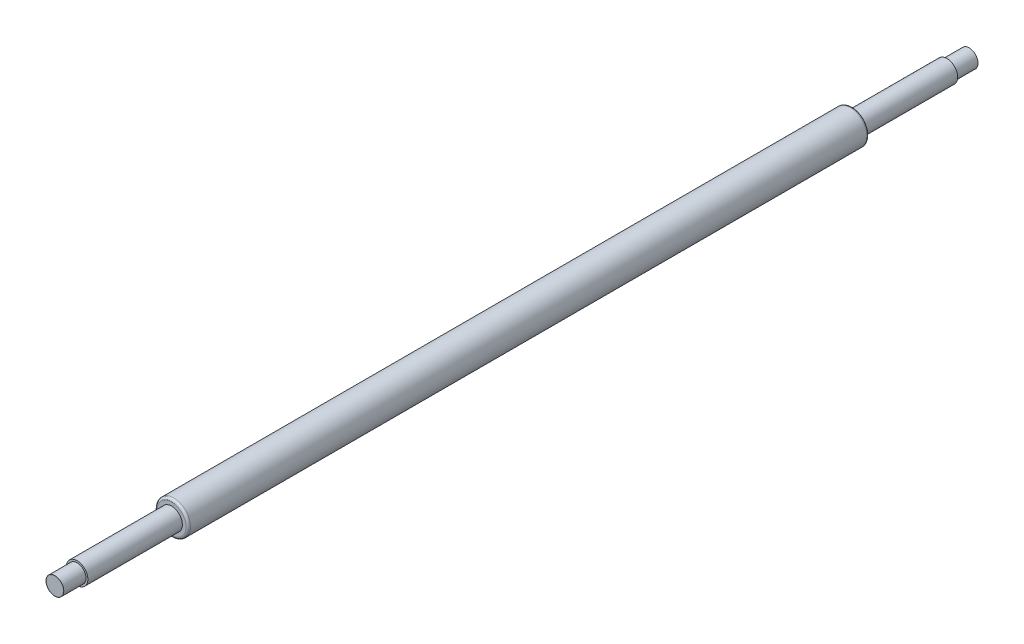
ISO-10303-21;
HEADER;
FILE_DESCRIPTION(('STEP AP214'),'2;1');
FILE_NAME('part.step','',(''),(''),'','','');
FILE_SCHEMA(('AUTOMOTIVE_DESIGN { 1 0 10303 214 1 1 1 1 }'));
ENDSEC;
DATA;
#1=APPLICATION_CONTEXT('core data for automotive mechanical design processes');
#2=APPLICATION_PROTOCOL_DEFINITION('international standard','automotive_design',2000,#1);
#3=PRODUCT_CONTEXT('',#1,'mechanical');
#4=PRODUCT('Part','Part','',(#3));
#5=PRODUCT_RELATED_PRODUCT_CATEGORY('part','',(#4));
#6=PRODUCT_DEFINITION_FORMATION('','',#4);
#7=PRODUCT_DEFINITION_CONTEXT('part definition',#1,'design');
#8=PRODUCT_DEFINITION('design','',#6,#7);
#9=PRODUCT_DEFINITION_SHAPE('','',#8);
#10=(LENGTH_UNIT() NAMED_UNIT(*) SI_UNIT(.MILLI.,.METRE.));
#11=(NAMED_UNIT(*) PLANE_ANGLE_UNIT() SI_UNIT($,.RADIAN.));
#12=(NAMED_UNIT(*) SI_UNIT($,.STERADIAN.) SOLID_ANGLE_UNIT());
#13=UNCERTAINTY_MEASURE_WITH_UNIT(LENGTH_MEASURE(1.E-05),#10,'distance_accuracy_value','');
#14=(GEOMETRIC_REPRESENTATION_CONTEXT(3) GLOBAL_UNCERTAINTY_ASSIGNED_CONTEXT((#13)) GLOBAL_UNIT_ASSIGNED_CONTEXT((#10,
#11,#12)) REPRESENTATION_CONTEXT('',''));
#15=CARTESIAN_POINT('',(0.,0.,0.));
#16=DIRECTION('',(0.,0.,1.));
#17=DIRECTION('',(1.,0.,0.));
#18=AXIS2_PLACEMENT_3D('',#15,#16,#17);
#19=CARTESIAN_POINT('',(0.,0.,455.549));
#20=DIRECTION('',(0.,0.,1.));
#21=DIRECTION('',(1.,0.,0.));
#22=AXIS2_PLACEMENT_3D('',#19,#20,#21);
#23=CYLINDRICAL_SURFACE('',#22,6.1595);
#24=CARTESIAN_POINT('',(0.,0.,455.549));
#25=DIRECTION('',(0.,0.,1.));
#26=DIRECTION('',(1.,0.,0.));
#27=AXIS2_PLACEMENT_3D('',#24,#25,#26);
#28=CIRCLE('',#27,6.1595);
#29=CARTESIAN_POINT('',(6.1595,0.,455.549));
#30=VERTEX_POINT('',#29);
#31=EDGE_CURVE('E57',#30,#30,#28,.T.);
#32=ORIENTED_EDGE('',*,*,#31,.T.);
#33=EDGE_LOOP('',(#32));
#34=FACE_BOUND('',#33,.T.);
#35=CARTESIAN_POINT('',(0.,0.,509.524));
#36=DIRECTION('',(0.,0.,1.));
#37=DIRECTION('',(1.,0.,0.));
#38=AXIS2_PLACEMENT_3D('',#35,#36,#37);
#39=CIRCLE('',#38,6.1595);
#40=CARTESIAN_POINT('',(6.1595,0.,509.524));
#41=VERTEX_POINT('',#40);
#42=EDGE_CURVE('E139',#41,#41,#39,.T.);
#43=ORIENTED_EDGE('',*,*,#42,.F.);
#44=EDGE_LOOP('',(#43));
#45=FACE_BOUND('',#44,.T.);
#46=ADVANCED_FACE('F34',(#34,#45),#23,.T.);
#47=CARTESIAN_POINT('',(0.,0.,66.675));
#48=DIRECTION('',(0.,0.,-1.));
#49=DIRECTION('',(-1.,0.,0.));
#50=AXIS2_PLACEMENT_3D('',#47,#48,#49);
#51=CYLINDRICAL_SURFACE('',#50,6.1595);
#52=CARTESIAN_POINT('',(0.,0.,66.675));
#53=DIRECTION('',(0.,0.,-1.));
#54=DIRECTION('',(-1.,0.,0.));
#55=AXIS2_PLACEMENT_3D('',#52,#53,#54);
#56=CIRCLE('',#55,6.1595);
#57=CARTESIAN_POINT('',(-6.1595,0.,66.675));
#58=VERTEX_POINT('',#57);
#59=EDGE_CURVE('E52',#58,#58,#56,.T.);
#60=ORIENTED_EDGE('',*,*,#59,.T.);
#61=EDGE_LOOP('',(#60));
#62=FACE_BOUND('',#61,.T.);
#63=CARTESIAN_POINT('',(0.,0.,12.7));
#64=DIRECTION('',(0.,0.,-1.));
#65=DIRECTION('',(-1.,0.,0.));
#66=AXIS2_PLACEMENT_3D('',#63,#64,#65);
#67=CIRCLE('',#66,6.1595);
#68=CARTESIAN_POINT('',(-6.1595,0.,12.7));
#69=VERTEX_POINT('',#68);
#70=EDGE_CURVE('E53',#69,#69,#67,.T.);
#71=ORIENTED_EDGE('',*,*,#70,.F.);
#72=EDGE_LOOP('',(#71));
#73=FACE_BOUND('',#72,.T.);
#74=ADVANCED_FACE('F97',(#62,#73),#51,.T.);
#75=CARTESIAN_POINT('',(0.,0.,522.224));
#76=DIRECTION('',(0.,0.,-1.));
#77=DIRECTION('',(-1.,0.,0.));
#78=AXIS2_PLACEMENT_3D('',#75,#76,#77);
#79=CYLINDRICAL_SURFACE('',#78,9.525);
#80=CARTESIAN_POINT('',(0.,0.,454.279));
#81=DIRECTION('',(0.,0.,1.));
#82=DIRECTION('',(1.,0.,0.));
#83=AXIS2_PLACEMENT_3D('',#80,#81,#82);
#84=CIRCLE('',#83,9.525);
#85=CARTESIAN_POINT('',(9.525,0.,454.279));
#86=VERTEX_POINT('',#85);
#87=EDGE_CURVE('E42',#86,#86,#84,.F.);
#88=ORIENTED_EDGE('',*,*,#87,.T.);
#89=EDGE_LOOP('',(#88));
#90=FACE_BOUND('',#89,.T.);
#91=CARTESIAN_POINT('',(0.,0.,67.945));
#92=DIRECTION('',(0.,0.,-1.));
#93=DIRECTION('',(-1.,0.,0.));
#94=AXIS2_PLACEMENT_3D('',#91,#92,#93);
#95=CIRCLE('',#94,9.525);
#96=CARTESIAN_POINT('',(-9.525,0.,67.945));
#97=VERTEX_POINT('',#96);
#98=EDGE_CURVE('E47',#97,#97,#95,.F.);
#99=ORIENTED_EDGE('',*,*,#98,.T.);
#100=EDGE_LOOP('',(#99));
#101=FACE_BOUND('',#100,.T.);
#102=ADVANCED_FACE('F81',(#90,#101),#79,.T.);
#103=CARTESIAN_POINT('',(0.,0.,455.549));
#104=DIRECTION('',(0.,0.,1.));
#105=DIRECTION('',(1.,0.,0.));
#106=AXIS2_PLACEMENT_3D('',#103,#104,#105);
#107=PLANE('',#106);
#108=CARTESIAN_POINT('',(0.,0.,455.549));
#109=DIRECTION('',(0.,0.,1.));
#110=DIRECTION('',(1.,0.,0.));
#111=AXIS2_PLACEMENT_3D('',#108,#109,#110);
#112=CIRCLE('',#111,8.255);
#113=CARTESIAN_POINT('',(8.255,0.,455.549));
#114=VERTEX_POINT('',#113);
#115=EDGE_CURVE('E76',#114,#114,#112,.T.);
#116=ORIENTED_EDGE('',*,*,#115,.T.);
#117=EDGE_LOOP('',(#116));
#118=FACE_BOUND('',#117,.T.);
#119=ORIENTED_EDGE('',*,*,#31,.F.);
#120=EDGE_LOOP('',(#119));
#121=FACE_BOUND('',#120,.T.);
#122=ADVANCED_FACE('F108',(#118,#121),#107,.T.);
#123=CARTESIAN_POINT('',(0.,0.,66.675));
#124=DIRECTION('',(0.,0.,-1.));
#125=DIRECTION('',(-1.,0.,0.));
#126=AXIS2_PLACEMENT_3D('',#123,#124,#125);
#127=PLANE('',#126);
#128=CARTESIAN_POINT('',(0.,0.,66.675));
#129=DIRECTION('',(0.,0.,-1.));
#130=DIRECTION('',(-1.,0.,0.));
#131=AXIS2_PLACEMENT_3D('',#128,#129,#130);
#132=CIRCLE('',#131,8.255);
#133=CARTESIAN_POINT('',(-8.255,0.,66.675));
#134=VERTEX_POINT('',#133);
#135=EDGE_CURVE('E10',#134,#134,#132,.T.);
#136=ORIENTED_EDGE('',*,*,#135,.T.);
#137=EDGE_LOOP('',(#136));
#138=FACE_BOUND('',#137,.T.);
#139=ORIENTED_EDGE('',*,*,#59,.F.);
#140=EDGE_LOOP('',(#139));
#141=FACE_BOUND('',#140,.T.);
#142=ADVANCED_FACE('F94',(#138,#141),#127,.T.);
#143=CARTESIAN_POINT('',(0.,0.,454.279));
#144=DIRECTION('',(0.,0.,1.));
#145=DIRECTION('',(1.,0.,0.));
#146=AXIS2_PLACEMENT_3D('',#143,#144,#145);
#147=TOROIDAL_SURFACE('',#146,8.255,1.27);
#148=ORIENTED_EDGE('',*,*,#87,.F.);
#149=EDGE_LOOP('',(#148));
#150=FACE_BOUND('',#149,.T.);
#151=ORIENTED_EDGE('',*,*,#115,.F.);
#152=EDGE_LOOP('',(#151));
#153=FACE_BOUND('',#152,.T.);
#154=ADVANCED_FACE('F86',(#150,#153),#147,.T.);
#155=CARTESIAN_POINT('',(0.,0.,67.945));
#156=DIRECTION('',(0.,0.,-1.));
#157=DIRECTION('',(-1.,0.,0.));
#158=AXIS2_PLACEMENT_3D('',#155,#156,#157);
#159=TOROIDAL_SURFACE('',#158,8.255,1.27);
#160=ORIENTED_EDGE('',*,*,#98,.F.);
#161=EDGE_LOOP('',(#160));
#162=FACE_BOUND('',#161,.T.);
#163=ORIENTED_EDGE('',*,*,#135,.F.);
#164=EDGE_LOOP('',(#163));
#165=FACE_BOUND('',#164,.T.);
#166=ADVANCED_FACE('F36',(#162,#165),#159,.T.);
#167=CARTESIAN_POINT('',(0.,0.,12.7));
#168=DIRECTION('',(0.,0.,-1.));
#169=DIRECTION('',(-1.,0.,0.));
#170=AXIS2_PLACEMENT_3D('',#167,#168,#169);
#171=PLANE('',#170);
#172=CARTESIAN_POINT('',(0.,0.,12.7));
#173=DIRECTION('',(0.,0.,-1.));
#174=DIRECTION('',(-1.,0.,0.));
#175=AXIS2_PLACEMENT_3D('',#172,#173,#174);
#176=CIRCLE('',#175,5.08);
#177=CARTESIAN_POINT('',(-5.08,0.,12.7));
#178=VERTEX_POINT('',#177);
#179=EDGE_CURVE('E60',#178,#178,#176,.T.);
#180=ORIENTED_EDGE('',*,*,#179,.F.);
#181=EDGE_LOOP('',(#180));
#182=FACE_BOUND('',#181,.T.);
#183=ORIENTED_EDGE('',*,*,#70,.T.);
#184=EDGE_LOOP('',(#183));
#185=FACE_BOUND('',#184,.T.);
#186=ADVANCED_FACE('F85',(#182,#185),#171,.T.);
#187=CARTESIAN_POINT('',(0.,0.,12.7));
#188=DIRECTION('',(0.,0.,-1.));
#189=DIRECTION('',(-1.,0.,0.));
#190=AXIS2_PLACEMENT_3D('',#187,#188,#189);
#191=CYLINDRICAL_SURFACE('',#190,5.08);
#192=CARTESIAN_POINT('',(0.,0.,0.0143687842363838));
#193=DIRECTION('',(0.,0.,1.));
#194=DIRECTION('',(1.,0.,0.));
#195=AXIS2_PLACEMENT_3D('',#192,#193,#194);
#196=CIRCLE('',#195,5.08);
#197=CARTESIAN_POINT('',(5.08,0.,0.0143687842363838));
#198=VERTEX_POINT('',#197);
#199=EDGE_CURVE('E50',#198,#198,#196,.F.);
#200=ORIENTED_EDGE('',*,*,#199,.F.);
#201=EDGE_LOOP('',(#200));
#202=FACE_BOUND('',#201,.T.);
#203=ORIENTED_EDGE('',*,*,#179,.T.);
#204=EDGE_LOOP('',(#203));
#205=FACE_BOUND('',#204,.T.);
#206=ADVANCED_FACE('F91',(#202,#205),#191,.T.);
#207=CARTESIAN_POINT('',(0.,0.,0.));
#208=DIRECTION('',(0.,0.,1.));
#209=DIRECTION('',(1.,0.,0.));
#210=AXIS2_PLACEMENT_3D('',#207,#208,#209);
#211=PLANE('',#210);
#212=CARTESIAN_POINT('',(0.,0.,0.));
#213=DIRECTION('',(0.,0.,1.));
#214=DIRECTION('',(1.,0.,0.));
#215=AXIS2_PLACEMENT_3D('',#212,#213,#214);
#216=CIRCLE('',#215,4.8895);
#217=CARTESIAN_POINT('',(4.8895,0.,0.));
#218=VERTEX_POINT('',#217);
#219=EDGE_CURVE('E70',#218,#218,#216,.F.);
#220=ORIENTED_EDGE('',*,*,#219,.T.);
#221=EDGE_LOOP('',(#220));
#222=FACE_BOUND('',#221,.T.);
#223=ADVANCED_FACE('F118',(#222),#211,.F.);
#224=CARTESIAN_POINT('',(0.,0.,1.26999999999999));
#225=DIRECTION('',(0.,0.,1.));
#226=DIRECTION('',(1.,0.,0.));
#227=AXIS2_PLACEMENT_3D('',#224,#225,#226);
#228=TOROIDAL_SURFACE('',#227,4.8895,1.27);
#229=ORIENTED_EDGE('',*,*,#219,.F.);
#230=EDGE_LOOP('',(#229));
#231=FACE_BOUND('',#230,.T.);
#232=ORIENTED_EDGE('',*,*,#199,.T.);
#233=EDGE_LOOP('',(#232));
#234=FACE_BOUND('',#233,.T.);
#235=ADVANCED_FACE('F121',(#231,#234),#228,.T.);
#236=CARTESIAN_POINT('',(0.,0.,509.524));
#237=DIRECTION('',(0.,0.,1.));
#238=DIRECTION('',(1.,0.,0.));
#239=AXIS2_PLACEMENT_3D('',#236,#237,#238);
#240=PLANE('',#239);
#241=CARTESIAN_POINT('',(0.,0.,509.524));
#242=DIRECTION('',(0.,0.,1.));
#243=DIRECTION('',(1.,0.,0.));
#244=AXIS2_PLACEMENT_3D('',#241,#242,#243);
#245=CIRCLE('',#244,5.08);
#246=CARTESIAN_POINT('',(5.08,0.,509.524));
#247=VERTEX_POINT('',#246);
#248=EDGE_CURVE('E141',#247,#247,#245,.T.);
#249=ORIENTED_EDGE('',*,*,#248,.F.);
#250=EDGE_LOOP('',(#249));
#251=FACE_BOUND('',#250,.T.);
#252=ORIENTED_EDGE('',*,*,#42,.T.);
#253=EDGE_LOOP('',(#252));
#254=FACE_BOUND('',#253,.T.);
#255=ADVANCED_FACE('F128',(#251,#254),#240,.T.);
#256=CARTESIAN_POINT('',(0.,0.,509.524));
#257=DIRECTION('',(0.,0.,1.));
#258=DIRECTION('',(1.,0.,0.));
#259=AXIS2_PLACEMENT_3D('',#256,#257,#258);
#260=CYLINDRICAL_SURFACE('',#259,5.08);
#261=CARTESIAN_POINT('',(0.,0.,522.209631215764));
#262=DIRECTION('',(0.,0.,-1.));
#263=DIRECTION('',(-1.,0.,0.));
#264=AXIS2_PLACEMENT_3D('',#261,#262,#263);
#265=CIRCLE('',#264,5.08);
#266=CARTESIAN_POINT('',(-5.08,0.,522.209631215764));
#267=VERTEX_POINT('',#266);
#268=EDGE_CURVE('E38',#267,#267,#265,.F.);
#269=ORIENTED_EDGE('',*,*,#268,.F.);
#270=EDGE_LOOP('',(#269));
#271=FACE_BOUND('',#270,.T.);
#272=ORIENTED_EDGE('',*,*,#248,.T.);
#273=EDGE_LOOP('',(#272));
#274=FACE_BOUND('',#273,.T.);
#275=ADVANCED_FACE('F116',(#271,#274),#260,.T.);
#276=CARTESIAN_POINT('',(0.,0.,522.224));
#277=DIRECTION('',(0.,0.,1.));
#278=DIRECTION('',(1.,0.,0.));
#279=AXIS2_PLACEMENT_3D('',#276,#277,#278);
#280=PLANE('',#279);
#281=CARTESIAN_POINT('',(0.,0.,522.224));
#282=DIRECTION('',(0.,0.,1.));
#283=DIRECTION('',(1.,0.,0.));
#284=AXIS2_PLACEMENT_3D('',#281,#282,#283);
#285=CIRCLE('',#284,4.8895);
#286=CARTESIAN_POINT('',(4.8895,0.,522.224));
#287=VERTEX_POINT('',#286);
#288=EDGE_CURVE('E73',#287,#287,#285,.T.);
#289=ORIENTED_EDGE('',*,*,#288,.T.);
#290=EDGE_LOOP('',(#289));
#291=FACE_BOUND('',#290,.T.);
#292=ADVANCED_FACE('F112',(#291),#280,.T.);
#293=CARTESIAN_POINT('',(0.,0.,520.954));
#294=DIRECTION('',(0.,0.,1.));
#295=DIRECTION('',(1.,0.,0.));
#296=AXIS2_PLACEMENT_3D('',#293,#294,#295);
#297=TOROIDAL_SURFACE('',#296,4.8895,1.27);
#298=ORIENTED_EDGE('',*,*,#288,.F.);
#299=EDGE_LOOP('',(#298));
#300=FACE_BOUND('',#299,.T.);
#301=ORIENTED_EDGE('',*,*,#268,.T.);
#302=EDGE_LOOP('',(#301));
#303=FACE_BOUND('',#302,.T.);
#304=ADVANCED_FACE('F115',(#300,#303),#297,.T.);
#305=CLOSED_SHELL('',(#46,#74,#102,#122,#142,#154,#166,#186,#206,#223,#235,#255,#275,#292,#304));
#306=MANIFOLD_SOLID_BREP('B2',#305);
#307=ADVANCED_BREP_SHAPE_REPRESENTATION('',(#18,#306),#14);
#308=SHAPE_DEFINITION_REPRESENTATION(#9,#307);
ENDSEC;
END-ISO-10303-21;
